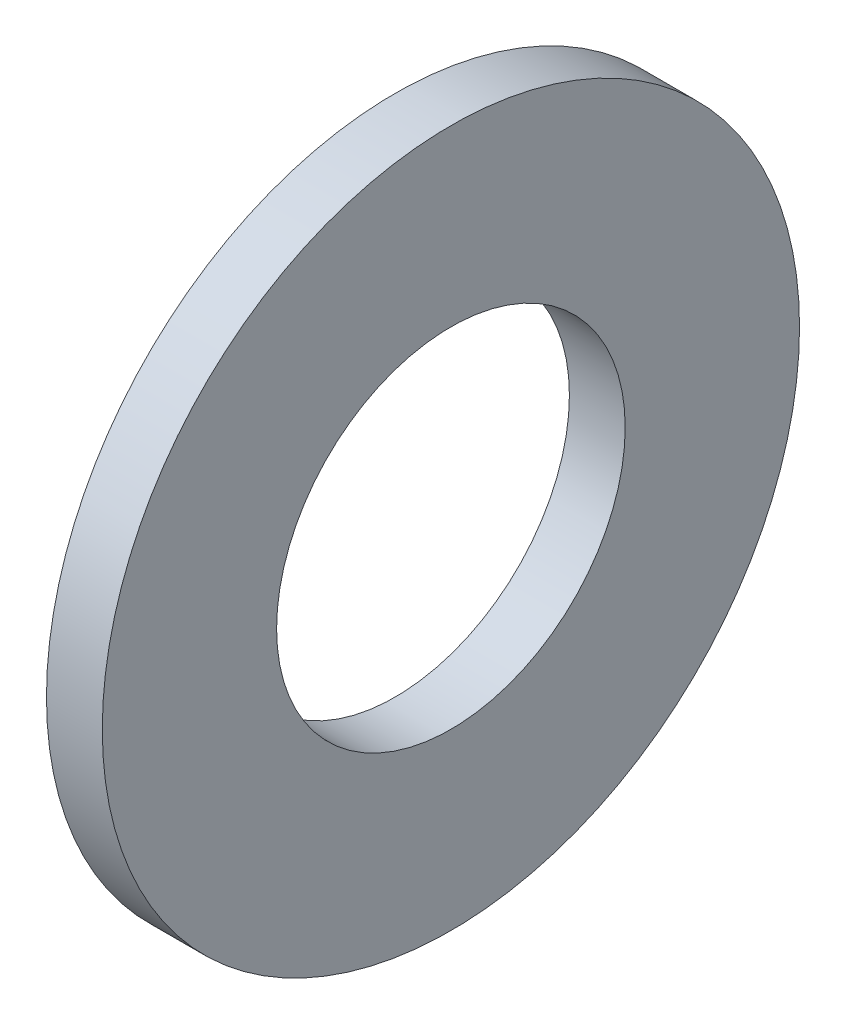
from build123d import *

# Parameters (mm, degrees)
SKETCH1_W = 1.651
SKETCH1_H = 5.1562


with BuildPart() as part:
    # Sketch1 → Base-Revolve (revolve)
    with BuildSketch(Plane.XY, mode=Mode.PRIVATE) as base_revolve_sk:
        with Locations((-0.8255, 7.7343)):
            Rectangle(SKETCH1_W, SKETCH1_H)
    revolve(base_revolve_sk.sketch.rotate(Axis((-34.925, 0, 0), (1, 0, 0)), 90), axis=Axis((-34.925, 0, 0), (1, 0, 0)))


solid = part.part
